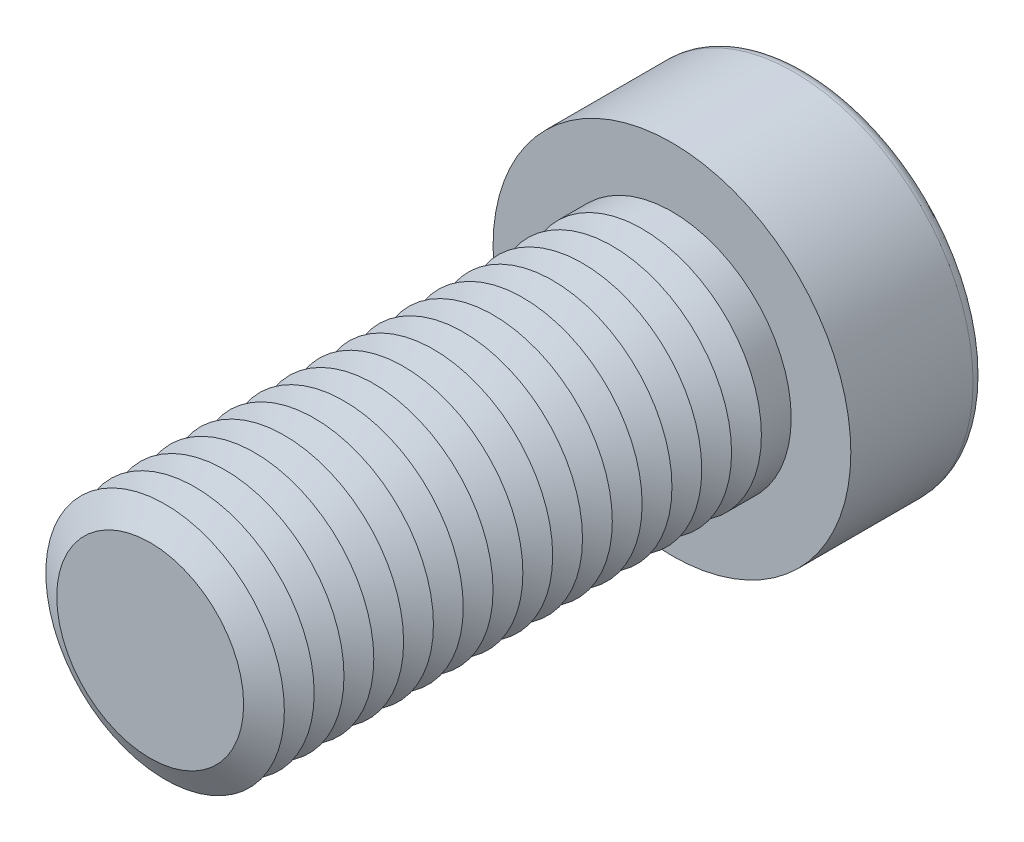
from build123d import *

# Parameters (mm, degrees)
SKETCH1_R           = 8
BOSS_EXTRUDE1_DEPTH = 35
SKETCH2_R           = 12
BOSS_EXTRUDE2_DEPTH = 9
CUT_EXTRUDE1_DEPTH  = 9
FILLET1_R           = 0.8
LPATTERN1_COUNT     = 17
LPATTERN1_PITCH     = 2


with BuildPart() as part:
    # Sketch1 → Boss-Extrude1 (new body)
    with BuildSketch(Plane.XY):
        Circle(SKETCH1_R)
    extrude(amount=BOSS_EXTRUDE1_DEPTH)

    # Sketch2 → Boss-Extrude2 (add)
    with BuildSketch(Plane(origin=(0, 0, 0), x_dir=(-1, 0, 0), z_dir=(0, 0, -1))):
        Circle(SKETCH2_R)
    extrude(amount=BOSS_EXTRUDE2_DEPTH)

    # Sketch3 → Cut-Extrude1 (cut)
    with BuildSketch(Plane(origin=(0, 0, -9), x_dir=(-1, 0, 0), z_dir=(0, 0, -1))):
        Polygon((-3.464101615, 6), (-6.92820323, 0), (-3.464101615, -6), (3.464101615, -6), (6.92820323, 0), (3.464101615, 6), align=None)
    extrude(amount=-CUT_EXTRUDE1_DEPTH, mode=Mode.SUBTRACT)

    # Fillet1
    fillet1_edges = [part.edges().sort_by_distance(p)[0] for p in [
        (12, 0, -9),
    ]]
    fillet(fillet1_edges, radius=FILLET1_R)

    # Cut-Extrude2 cone 1 section (on through the dimple's axis) → Cut-Extrude2 (revolve, cut)
    with BuildSketch(Plane.YZ):
        Polygon((0, 0), (6, 0), (0, 3.464101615), align=None)
    revolve(axis=Axis((0, 0, 0), (0, 0, 1)), mode=Mode.SUBTRACT)

    # Cut-Extrude3 cone 1 section (on through the dimple's axis) → Cut-Extrude3 (revolve, cut)
    with BuildSketch(Plane(origin=(0, 0, -9), x_dir=(0, 1, 0), z_dir=(1, 0, 0))):
        Polygon((0, 0), (6.92820323, 0), (0, 1.856406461), align=None)
    revolve(axis=Axis((0, 0, -9), (0, 0, 1)), mode=Mode.SUBTRACT)

    # Sketch7 → Cut-Revolve1 (revolve, cut)
    with BuildSketch(Plane(origin=(0, 0, 0), x_dir=(0, 0, -1), z_dir=(1, 0, 0)), mode=Mode.PRIVATE) as cut_revolve1_sk:
        Polygon((-35, 6.267949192), (-34, 8), (-36, 8), align=None)
    cut_revolve1 = revolve(cut_revolve1_sk.sketch.rotate(Axis((0, 0, 35), (0, 0, -1)), 90), axis=Axis((0, 0, 35), (0, 0, -1)), mode=Mode.SUBTRACT)

    # LPattern1: Cut-Revolve1 ×17
    with Locations(*[(0, 0, -i * LPATTERN1_PITCH) for i in range(1, LPATTERN1_COUNT)]):
        add(cut_revolve1, mode=Mode.SUBTRACT)


solid = part.part
